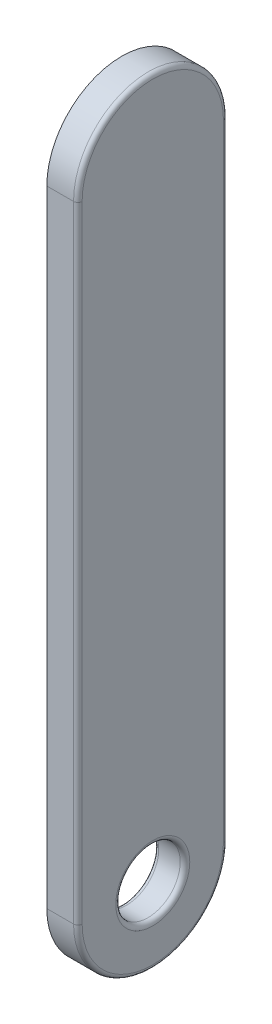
ISO-10303-21;
HEADER;
FILE_DESCRIPTION(('STEP AP214'),'2;1');
FILE_NAME('part.step','',(''),(''),'','','');
FILE_SCHEMA(('AUTOMOTIVE_DESIGN { 1 0 10303 214 1 1 1 1 }'));
ENDSEC;
DATA;
#1=APPLICATION_CONTEXT('core data for automotive mechanical design processes');
#2=APPLICATION_PROTOCOL_DEFINITION('international standard','automotive_design',2000,#1);
#3=PRODUCT_CONTEXT('',#1,'mechanical');
#4=PRODUCT('Part','Part','',(#3));
#5=PRODUCT_RELATED_PRODUCT_CATEGORY('part','',(#4));
#6=PRODUCT_DEFINITION_FORMATION('','',#4);
#7=PRODUCT_DEFINITION_CONTEXT('part definition',#1,'design');
#8=PRODUCT_DEFINITION('design','',#6,#7);
#9=PRODUCT_DEFINITION_SHAPE('','',#8);
#10=(LENGTH_UNIT() NAMED_UNIT(*) SI_UNIT(.MILLI.,.METRE.));
#11=(NAMED_UNIT(*) PLANE_ANGLE_UNIT() SI_UNIT($,.RADIAN.));
#12=(NAMED_UNIT(*) SI_UNIT($,.STERADIAN.) SOLID_ANGLE_UNIT());
#13=UNCERTAINTY_MEASURE_WITH_UNIT(LENGTH_MEASURE(1.E-05),#10,'distance_accuracy_value','');
#14=(GEOMETRIC_REPRESENTATION_CONTEXT(3) GLOBAL_UNCERTAINTY_ASSIGNED_CONTEXT((#13)) GLOBAL_UNIT_ASSIGNED_CONTEXT((#10,
#11,#12)) REPRESENTATION_CONTEXT('',''));
#15=CARTESIAN_POINT('',(0.,0.,0.));
#16=DIRECTION('',(0.,0.,1.));
#17=DIRECTION('',(1.,0.,0.));
#18=AXIS2_PLACEMENT_3D('',#15,#16,#17);
#19=CARTESIAN_POINT('',(39.15,-2.51999999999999,3.99999999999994));
#20=DIRECTION('',(1.,0.,0.));
#21=DIRECTION('',(0.,0.,-1.));
#22=AXIS2_PLACEMENT_3D('',#19,#20,#21);
#23=PLANE('',#22);
#24=CARTESIAN_POINT('',(39.15,-15.63,3.99999999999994));
#25=DIRECTION('',(1.,0.,0.));
#26=DIRECTION('',(0.,0.,1.));
#27=AXIS2_PLACEMENT_3D('',#24,#25,#26);
#28=CIRCLE('',#27,0.775);
#29=CARTESIAN_POINT('',(39.15,-15.63,4.77499999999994));
#30=VERTEX_POINT('',#29);
#31=EDGE_CURVE('E156',#30,#30,#28,.T.);
#32=ORIENTED_EDGE('',*,*,#31,.F.);
#33=EDGE_LOOP('',(#32));
#34=FACE_BOUND('',#33,.T.);
#35=CARTESIAN_POINT('',(39.15,-2.51999999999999,3.99999999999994));
#36=DIRECTION('',(-1.,0.,0.));
#37=DIRECTION('',(0.,0.,1.));
#38=AXIS2_PLACEMENT_3D('',#35,#36,#37);
#39=CIRCLE('',#38,1.48);
#40=CARTESIAN_POINT('',(39.15,-2.51999999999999,5.47999999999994));
#41=VERTEX_POINT('',#40);
#42=CARTESIAN_POINT('',(39.15,-2.51999999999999,2.51999999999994));
#43=VERTEX_POINT('',#42);
#44=EDGE_CURVE('E229',#41,#43,#39,.T.);
#45=ORIENTED_EDGE('',*,*,#44,.F.);
#46=DIRECTION('',(0.,1.,0.));
#47=VECTOR('',#46,1.);
#48=CARTESIAN_POINT('',(39.15,-2.51999999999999,5.47999999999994));
#49=LINE('',#48,#47);
#50=CARTESIAN_POINT('',(39.15,-15.63,5.47999999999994));
#51=VERTEX_POINT('',#50);
#52=EDGE_CURVE('E147',#51,#41,#49,.T.);
#53=ORIENTED_EDGE('',*,*,#52,.F.);
#54=CARTESIAN_POINT('',(39.15,-15.63,3.99999999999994));
#55=DIRECTION('',(-1.,0.,0.));
#56=DIRECTION('',(0.,0.,-1.));
#57=AXIS2_PLACEMENT_3D('',#54,#55,#56);
#58=CIRCLE('',#57,1.48);
#59=CARTESIAN_POINT('',(39.15,-15.63,2.51999999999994));
#60=VERTEX_POINT('',#59);
#61=EDGE_CURVE('E165',#60,#51,#58,.T.);
#62=ORIENTED_EDGE('',*,*,#61,.F.);
#63=DIRECTION('',(0.,-1.,0.));
#64=VECTOR('',#63,1.);
#65=CARTESIAN_POINT('',(39.15,-2.51999999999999,2.51999999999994));
#66=LINE('',#65,#64);
#67=EDGE_CURVE('E193',#43,#60,#66,.T.);
#68=ORIENTED_EDGE('',*,*,#67,.F.);
#69=EDGE_LOOP('',(#45,#53,#62,#68));
#70=FACE_BOUND('',#69,.T.);
#71=ADVANCED_FACE('F17',(#34,#70),#23,.T.);
#72=CARTESIAN_POINT('',(39.05,-15.63,3.99999999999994));
#73=DIRECTION('',(1.,0.,0.));
#74=DIRECTION('',(0.,0.,-1.));
#75=AXIS2_PLACEMENT_3D('',#72,#73,#74);
#76=TOROIDAL_SURFACE('',#75,0.775,0.1);
#77=ORIENTED_EDGE('',*,*,#31,.T.);
#78=EDGE_LOOP('',(#77));
#79=FACE_BOUND('',#78,.T.);
#80=CARTESIAN_POINT('',(39.05,-15.63,3.99999999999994));
#81=DIRECTION('',(1.,0.,0.));
#82=DIRECTION('',(0.,0.,-1.));
#83=AXIS2_PLACEMENT_3D('',#80,#81,#82);
#84=CIRCLE('',#83,0.675);
#85=CARTESIAN_POINT('',(39.05,-15.63,3.32499999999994));
#86=VERTEX_POINT('',#85);
#87=EDGE_CURVE('E114',#86,#86,#84,.F.);
#88=ORIENTED_EDGE('',*,*,#87,.T.);
#89=EDGE_LOOP('',(#88));
#90=FACE_BOUND('',#89,.T.);
#91=ADVANCED_FACE('F195',(#79,#90),#76,.T.);
#92=CARTESIAN_POINT('',(39.06,-2.51999999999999,5.47999999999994));
#93=DIRECTION('',(0.,1.,0.));
#94=DIRECTION('',(0.,0.,1.));
#95=AXIS2_PLACEMENT_3D('',#92,#93,#94);
#96=CYLINDRICAL_SURFACE('',#95,0.0899999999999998);
#97=CARTESIAN_POINT('',(39.06,-15.63,5.47999999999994));
#98=DIRECTION('',(0.,-1.,0.));
#99=DIRECTION('',(0.,0.,1.));
#100=AXIS2_PLACEMENT_3D('',#97,#98,#99);
#101=CIRCLE('',#100,0.09);
#102=CARTESIAN_POINT('',(39.06,-15.63,5.56999999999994));
#103=VERTEX_POINT('',#102);
#104=EDGE_CURVE('E155',#51,#103,#101,.T.);
#105=ORIENTED_EDGE('',*,*,#104,.F.);
#106=ORIENTED_EDGE('',*,*,#52,.T.);
#107=CARTESIAN_POINT('',(39.06,-2.51999999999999,5.47999999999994));
#108=DIRECTION('',(0.,-1.,0.));
#109=DIRECTION('',(0.,0.,1.));
#110=AXIS2_PLACEMENT_3D('',#107,#108,#109);
#111=CIRCLE('',#110,0.09);
#112=CARTESIAN_POINT('',(39.06,-2.51999999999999,5.56999999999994));
#113=VERTEX_POINT('',#112);
#114=EDGE_CURVE('E233',#113,#41,#111,.F.);
#115=ORIENTED_EDGE('',*,*,#114,.F.);
#116=DIRECTION('',(0.,1.,0.));
#117=VECTOR('',#116,1.);
#118=CARTESIAN_POINT('',(39.06,-2.51999999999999,5.56999999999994));
#119=LINE('',#118,#117);
#120=EDGE_CURVE('E117',#113,#103,#119,.F.);
#121=ORIENTED_EDGE('',*,*,#120,.T.);
#122=EDGE_LOOP('',(#105,#106,#115,#121));
#123=FACE_BOUND('',#122,.T.);
#124=ADVANCED_FACE('F182',(#123),#96,.T.);
#125=CARTESIAN_POINT('',(39.06,-15.63,3.99999999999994));
#126=DIRECTION('',(1.,0.,0.));
#127=DIRECTION('',(0.,0.,-1.));
#128=AXIS2_PLACEMENT_3D('',#125,#126,#127);
#129=TOROIDAL_SURFACE('',#128,1.48,0.09);
#130=CARTESIAN_POINT('',(39.06,-15.63,2.51999999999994));
#131=DIRECTION('',(0.,-1.,0.));
#132=DIRECTION('',(0.,0.,-1.));
#133=AXIS2_PLACEMENT_3D('',#130,#131,#132);
#134=CIRCLE('',#133,0.0899999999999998);
#135=CARTESIAN_POINT('',(39.06,-15.63,2.42999999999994));
#136=VERTEX_POINT('',#135);
#137=EDGE_CURVE('E215',#60,#136,#134,.F.);
#138=ORIENTED_EDGE('',*,*,#137,.F.);
#139=ORIENTED_EDGE('',*,*,#61,.T.);
#140=ORIENTED_EDGE('',*,*,#104,.T.);
#141=CARTESIAN_POINT('',(39.06,-15.63,3.99999999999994));
#142=DIRECTION('',(-1.,0.,0.));
#143=DIRECTION('',(0.,0.,1.));
#144=AXIS2_PLACEMENT_3D('',#141,#142,#143);
#145=CIRCLE('',#144,1.57);
#146=EDGE_CURVE('E56',#136,#103,#145,.T.);
#147=ORIENTED_EDGE('',*,*,#146,.F.);
#148=EDGE_LOOP('',(#138,#139,#140,#147));
#149=FACE_BOUND('',#148,.T.);
#150=ADVANCED_FACE('F172',(#149),#129,.T.);
#151=CARTESIAN_POINT('',(39.06,-2.51999999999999,2.51999999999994));
#152=DIRECTION('',(0.,-1.,0.));
#153=DIRECTION('',(0.,0.,-1.));
#154=AXIS2_PLACEMENT_3D('',#151,#152,#153);
#155=CYLINDRICAL_SURFACE('',#154,0.0899999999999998);
#156=CARTESIAN_POINT('',(39.06,-2.51999999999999,2.51999999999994));
#157=DIRECTION('',(0.,1.,0.));
#158=DIRECTION('',(0.,0.,-1.));
#159=AXIS2_PLACEMENT_3D('',#156,#157,#158);
#160=CIRCLE('',#159,0.09);
#161=CARTESIAN_POINT('',(39.06,-2.51999999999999,2.42999999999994));
#162=VERTEX_POINT('',#161);
#163=EDGE_CURVE('E118',#43,#162,#160,.T.);
#164=ORIENTED_EDGE('',*,*,#163,.F.);
#165=ORIENTED_EDGE('',*,*,#67,.T.);
#166=ORIENTED_EDGE('',*,*,#137,.T.);
#167=DIRECTION('',(0.,-1.,0.));
#168=VECTOR('',#167,1.);
#169=CARTESIAN_POINT('',(39.06,-15.63,2.42999999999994));
#170=LINE('',#169,#168);
#171=EDGE_CURVE('E106',#136,#162,#170,.F.);
#172=ORIENTED_EDGE('',*,*,#171,.T.);
#173=EDGE_LOOP('',(#164,#165,#166,#172));
#174=FACE_BOUND('',#173,.T.);
#175=ADVANCED_FACE('F136',(#174),#155,.T.);
#176=CARTESIAN_POINT('',(39.06,-2.51999999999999,3.99999999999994));
#177=DIRECTION('',(1.,0.,0.));
#178=DIRECTION('',(0.,0.,-1.));
#179=AXIS2_PLACEMENT_3D('',#176,#177,#178);
#180=TOROIDAL_SURFACE('',#179,1.48,0.09);
#181=ORIENTED_EDGE('',*,*,#163,.T.);
#182=CARTESIAN_POINT('',(39.06,-2.51999999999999,3.99999999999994));
#183=DIRECTION('',(-1.,0.,0.));
#184=DIRECTION('',(0.,0.,1.));
#185=AXIS2_PLACEMENT_3D('',#182,#183,#184);
#186=CIRCLE('',#185,1.57);
#187=EDGE_CURVE('E102',#113,#162,#186,.T.);
#188=ORIENTED_EDGE('',*,*,#187,.F.);
#189=ORIENTED_EDGE('',*,*,#114,.T.);
#190=ORIENTED_EDGE('',*,*,#44,.T.);
#191=EDGE_LOOP('',(#181,#188,#189,#190));
#192=FACE_BOUND('',#191,.T.);
#193=ADVANCED_FACE('F130',(#192),#180,.T.);
#194=CARTESIAN_POINT('',(38.5,-15.63,3.99999999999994));
#195=DIRECTION('',(1.,0.,0.));
#196=DIRECTION('',(0.,0.,-1.));
#197=AXIS2_PLACEMENT_3D('',#194,#195,#196);
#198=CYLINDRICAL_SURFACE('',#197,0.675);
#199=ORIENTED_EDGE('',*,*,#87,.F.);
#200=EDGE_LOOP('',(#199));
#201=FACE_BOUND('',#200,.T.);
#202=CARTESIAN_POINT('',(38.6,-15.63,3.99999999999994));
#203=DIRECTION('',(1.,0.,0.));
#204=DIRECTION('',(0.,0.,-1.));
#205=AXIS2_PLACEMENT_3D('',#202,#203,#204);
#206=CIRCLE('',#205,0.675);
#207=CARTESIAN_POINT('',(38.6,-15.63,3.32499999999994));
#208=VERTEX_POINT('',#207);
#209=EDGE_CURVE('E73',#208,#208,#206,.T.);
#210=ORIENTED_EDGE('',*,*,#209,.F.);
#211=EDGE_LOOP('',(#210));
#212=FACE_BOUND('',#211,.T.);
#213=ADVANCED_FACE('F135',(#201,#212),#198,.F.);
#214=CARTESIAN_POINT('',(39.15,-2.51999999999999,5.56999999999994));
#215=DIRECTION('',(0.,0.,-1.));
#216=DIRECTION('',(0.,1.,0.));
#217=AXIS2_PLACEMENT_3D('',#214,#215,#216);
#218=PLANE('',#217);
#219=ORIENTED_EDGE('',*,*,#120,.F.);
#220=DIRECTION('',(-1.,0.,0.));
#221=VECTOR('',#220,1.);
#222=CARTESIAN_POINT('',(39.15,-2.51999999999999,5.56999999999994));
#223=LINE('',#222,#221);
#224=CARTESIAN_POINT('',(38.5,-2.51999999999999,5.56999999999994));
#225=VERTEX_POINT('',#224);
#226=EDGE_CURVE('E72',#225,#113,#223,.F.);
#227=ORIENTED_EDGE('',*,*,#226,.F.);
#228=DIRECTION('',(0.,1.,0.));
#229=VECTOR('',#228,1.);
#230=CARTESIAN_POINT('',(38.5,-2.51999999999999,5.56999999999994));
#231=LINE('',#230,#229);
#232=CARTESIAN_POINT('',(38.5,-15.63,5.56999999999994));
#233=VERTEX_POINT('',#232);
#234=EDGE_CURVE('E66',#225,#233,#231,.F.);
#235=ORIENTED_EDGE('',*,*,#234,.T.);
#236=DIRECTION('',(-1.,0.,0.));
#237=VECTOR('',#236,1.);
#238=CARTESIAN_POINT('',(39.15,-15.63,5.56999999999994));
#239=LINE('',#238,#237);
#240=EDGE_CURVE('E50',#103,#233,#239,.T.);
#241=ORIENTED_EDGE('',*,*,#240,.F.);
#242=EDGE_LOOP('',(#219,#227,#235,#241));
#243=FACE_BOUND('',#242,.T.);
#244=ADVANCED_FACE('F70',(#243),#218,.F.);
#245=CARTESIAN_POINT('',(39.15,-15.63,3.99999999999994));
#246=DIRECTION('',(-1.,0.,0.));
#247=DIRECTION('',(0.,0.,1.));
#248=AXIS2_PLACEMENT_3D('',#245,#246,#247);
#249=CYLINDRICAL_SURFACE('',#248,1.57);
#250=ORIENTED_EDGE('',*,*,#240,.T.);
#251=CARTESIAN_POINT('',(38.5,-15.63,3.99999999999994));
#252=DIRECTION('',(-1.,0.,0.));
#253=DIRECTION('',(0.,0.,1.));
#254=AXIS2_PLACEMENT_3D('',#251,#252,#253);
#255=CIRCLE('',#254,1.57);
#256=CARTESIAN_POINT('',(38.5,-15.63,2.42999999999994));
#257=VERTEX_POINT('',#256);
#258=EDGE_CURVE('E21',#233,#257,#255,.F.);
#259=ORIENTED_EDGE('',*,*,#258,.T.);
#260=DIRECTION('',(1.,0.,0.));
#261=VECTOR('',#260,1.);
#262=CARTESIAN_POINT('',(39.15,-15.63,2.42999999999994));
#263=LINE('',#262,#261);
#264=EDGE_CURVE('E61',#257,#136,#263,.T.);
#265=ORIENTED_EDGE('',*,*,#264,.T.);
#266=ORIENTED_EDGE('',*,*,#146,.T.);
#267=EDGE_LOOP('',(#250,#259,#265,#266));
#268=FACE_BOUND('',#267,.T.);
#269=ADVANCED_FACE('F52',(#268),#249,.T.);
#270=CARTESIAN_POINT('',(39.15,-15.63,2.42999999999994));
#271=DIRECTION('',(0.,0.,1.));
#272=DIRECTION('',(0.,-1.,0.));
#273=AXIS2_PLACEMENT_3D('',#270,#271,#272);
#274=PLANE('',#273);
#275=ORIENTED_EDGE('',*,*,#171,.F.);
#276=ORIENTED_EDGE('',*,*,#264,.F.);
#277=DIRECTION('',(0.,1.,0.));
#278=VECTOR('',#277,1.);
#279=CARTESIAN_POINT('',(38.5,-2.51999999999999,2.42999999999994));
#280=LINE('',#279,#278);
#281=CARTESIAN_POINT('',(38.5,-2.51999999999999,2.42999999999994));
#282=VERTEX_POINT('',#281);
#283=EDGE_CURVE('E69',#257,#282,#280,.T.);
#284=ORIENTED_EDGE('',*,*,#283,.T.);
#285=DIRECTION('',(-1.,0.,0.));
#286=VECTOR('',#285,1.);
#287=CARTESIAN_POINT('',(39.15,-2.51999999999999,2.42999999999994));
#288=LINE('',#287,#286);
#289=EDGE_CURVE('E34',#162,#282,#288,.T.);
#290=ORIENTED_EDGE('',*,*,#289,.F.);
#291=EDGE_LOOP('',(#275,#276,#284,#290));
#292=FACE_BOUND('',#291,.T.);
#293=ADVANCED_FACE('F208',(#292),#274,.F.);
#294=CARTESIAN_POINT('',(39.15,-2.51999999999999,3.99999999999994));
#295=DIRECTION('',(-1.,0.,0.));
#296=DIRECTION('',(0.,0.,1.));
#297=AXIS2_PLACEMENT_3D('',#294,#295,#296);
#298=CYLINDRICAL_SURFACE('',#297,1.57);
#299=ORIENTED_EDGE('',*,*,#289,.T.);
#300=CARTESIAN_POINT('',(38.5,-2.51999999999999,3.99999999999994));
#301=DIRECTION('',(-1.,0.,0.));
#302=DIRECTION('',(0.,0.,1.));
#303=AXIS2_PLACEMENT_3D('',#300,#301,#302);
#304=CIRCLE('',#303,1.57);
#305=EDGE_CURVE('E27',#282,#225,#304,.F.);
#306=ORIENTED_EDGE('',*,*,#305,.T.);
#307=ORIENTED_EDGE('',*,*,#226,.T.);
#308=ORIENTED_EDGE('',*,*,#187,.T.);
#309=EDGE_LOOP('',(#299,#306,#307,#308));
#310=FACE_BOUND('',#309,.T.);
#311=ADVANCED_FACE('F88',(#310),#298,.T.);
#312=CARTESIAN_POINT('',(38.6,-15.63,3.99999999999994));
#313=DIRECTION('',(1.,0.,0.));
#314=DIRECTION('',(0.,0.,-1.));
#315=AXIS2_PLACEMENT_3D('',#312,#313,#314);
#316=TOROIDAL_SURFACE('',#315,0.775,0.1);
#317=ORIENTED_EDGE('',*,*,#209,.T.);
#318=EDGE_LOOP('',(#317));
#319=FACE_BOUND('',#318,.T.);
#320=CARTESIAN_POINT('',(38.5,-15.63,3.99999999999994));
#321=DIRECTION('',(-1.,0.,0.));
#322=DIRECTION('',(0.,0.,1.));
#323=AXIS2_PLACEMENT_3D('',#320,#321,#322);
#324=CIRCLE('',#323,0.775);
#325=CARTESIAN_POINT('',(38.5,-15.63,4.77499999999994));
#326=VERTEX_POINT('',#325);
#327=EDGE_CURVE('E11',#326,#326,#324,.T.);
#328=ORIENTED_EDGE('',*,*,#327,.T.);
#329=EDGE_LOOP('',(#328));
#330=FACE_BOUND('',#329,.T.);
#331=ADVANCED_FACE('F83',(#319,#330),#316,.T.);
#332=CARTESIAN_POINT('',(38.5,-2.51999999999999,3.99999999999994));
#333=DIRECTION('',(1.,0.,0.));
#334=DIRECTION('',(0.,0.,-1.));
#335=AXIS2_PLACEMENT_3D('',#332,#333,#334);
#336=PLANE('',#335);
#337=ORIENTED_EDGE('',*,*,#327,.F.);
#338=EDGE_LOOP('',(#337));
#339=FACE_BOUND('',#338,.T.);
#340=ORIENTED_EDGE('',*,*,#283,.F.);
#341=ORIENTED_EDGE('',*,*,#258,.F.);
#342=ORIENTED_EDGE('',*,*,#234,.F.);
#343=ORIENTED_EDGE('',*,*,#305,.F.);
#344=EDGE_LOOP('',(#340,#341,#342,#343));
#345=FACE_BOUND('',#344,.T.);
#346=ADVANCED_FACE('F65',(#339,#345),#336,.F.);
#347=CLOSED_SHELL('',(#71,#91,#124,#150,#175,#193,#213,#244,#269,#293,#311,#331,#346));
#348=MANIFOLD_SOLID_BREP('B1',#347);
#349=ADVANCED_BREP_SHAPE_REPRESENTATION('',(#18,#348),#14);
#350=SHAPE_DEFINITION_REPRESENTATION(#9,#349);
ENDSEC;
END-ISO-10303-21;
